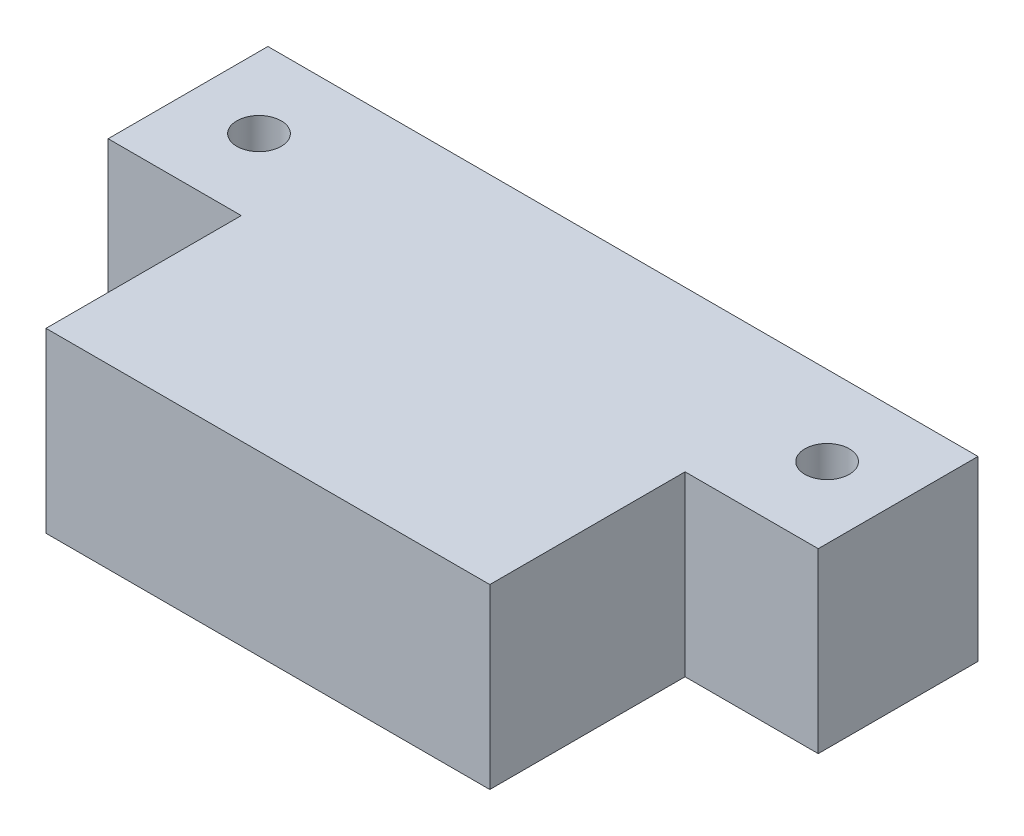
from build123d import *

# Parameters (mm, degrees)
SALIENTE_EXTRUIR1_DEPTH = 20
CROQUIS2_R              = 2.5
CORTAR_EXTRUIR1_DEPTH   = 20
CROQUIS3_R              = 2.5
CORTAR_EXTRUIR2_DEPTH   = 20


with BuildPart() as part:
    # Croquis1 → Saliente-Extruir1 (new body)
    with BuildSketch(Plane(origin=(0, 0, 0), x_dir=(1, 0, 0), z_dir=(0, 1, 0))):
        Polygon((-25, -20), (25, -20), (25, 2), (40, 2), (40, 20), (-40, 20), (-40, 2), (-25, 2), align=None)
    extrude(amount=SALIENTE_EXTRUIR1_DEPTH)

    # Croquis2 → Cortar-Extruir1 (cut)
    with BuildSketch(Plane(origin=(0, 20, 0), x_dir=(1, 0, 0), z_dir=(0, 1, 0))):
        with Locations(Location((-32, 11, 0), (0, 0, 270))):
            Circle(CROQUIS2_R)
    extrude(amount=-CORTAR_EXTRUIR1_DEPTH, mode=Mode.SUBTRACT)

    # Croquis3 → Cortar-Extruir2 (cut)
    with BuildSketch(Plane(origin=(0, 20, 0), x_dir=(1, 0, 0), z_dir=(0, 1, 0))):
        with Locations(Location((32, 11, 0), (0, 0, 270))):
            Circle(CROQUIS3_R)
    extrude(amount=-CORTAR_EXTRUIR2_DEPTH, mode=Mode.SUBTRACT)


solid = part.part
